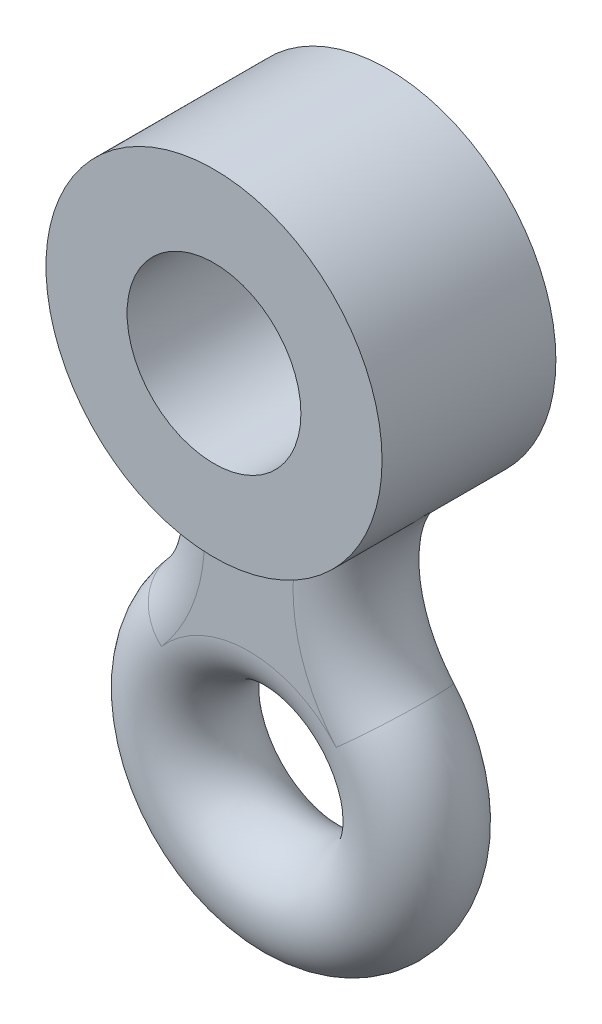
from build123d import *

# Parameters (mm, degrees)
ESQUISSE2_R             = 9
ESQUISSE4_R             = 9
ESQUISSE5_R             = 29
BOSS_EXTRU_1_DEPTH      = 15
BOSS_EXTRU_2_DEPTH      = 9
ESQUISSE7_R             = 15
ENL_V_MAT_EXTRU_1_DEPTH = 47.000000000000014


with BuildPart() as part:
    # Base-Balayage: sweep along a path in Esquisse1
    with BuildLine(Plane.XY) as base_balayage_path:
        CenterArc((0, 0), 20.000000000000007, 0, 360)
    # Esquisse2 → Base-Balayage (sweep)
    with BuildSketch(Plane(origin=(0, 0, 0), x_dir=(1, 0, 0), z_dir=(0, 1, 0))):
        with Locations((20, 0)):
            Circle(ESQUISSE2_R)
    sweep(path=base_balayage_path.line)

    # Boss.-Balayage1: sweep along a path in Esquisse3
    with BuildLine(Plane.XY) as boss_balayage1_path:
        ThreePointArc((-15.075014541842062, 13.143208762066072), (-7.64074998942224, 32.99063989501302), (-15.085213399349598, 52.83424784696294))
    # Esquisse4 → Boss.-Balayage1 (sweep)
    with BuildSketch(Plane(origin=(0, 0, 0), x_dir=(0.7537507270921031, -0.6571604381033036, 0), z_dir=(-0.6571604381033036, -0.7537507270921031, 0))):
        with Locations((-20, 0)):
            Circle(ESQUISSE4_R)
    boss_balayage1 = sweep(path=boss_balayage1_path.line)

    # Sym_trie1: Boss.-Balayage1 across plane
    add(boss_balayage1.mirror(Plane(origin=(0, 0, 0), x_dir=(0, 0, 1), z_dir=(1, 0, 0))))

    # Esquisse5 → Boss.-Extru.1 (add, symmetric)
    with BuildSketch(Plane.XY):
        with Locations((0, 66)):
            Circle(ESQUISSE5_R)
    extrude(amount=BOSS_EXTRU_1_DEPTH, both=True)

    # Esquisse6 → Boss.-Extru.2 (add, symmetric)
    with BuildSketch(Plane.XY):
        with BuildLine():
            ThreePointArc((15.075014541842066, 13.143208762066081), (-3.22e-15, 20.000000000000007), (-15.07501454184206, 13.143208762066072))
            ThreePointArc((-15.07501454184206, 13.143208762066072), (-8.7548872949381, 24.8569752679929), (-8.086251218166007, 38.15017879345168))
            ThreePointArc((-8.086251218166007, 38.15017879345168), (1.78e-15, 37), (8.086251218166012, 38.15017879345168))
            ThreePointArc((8.086251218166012, 38.15017879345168), (8.754887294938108, 24.856975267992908), (15.075014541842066, 13.143208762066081))
        make_face()
    extrude(amount=BOSS_EXTRU_2_DEPTH, both=True)

    # Esquisse7 → Enl_v. mat.-Extru.1 (cut)
    with BuildSketch(Plane.XY.offset(15)):
        with Locations((0, 66)):
            Circle(ESQUISSE7_R)
    extrude(amount=-ENL_V_MAT_EXTRU_1_DEPTH, mode=Mode.SUBTRACT)


solid = part.part
